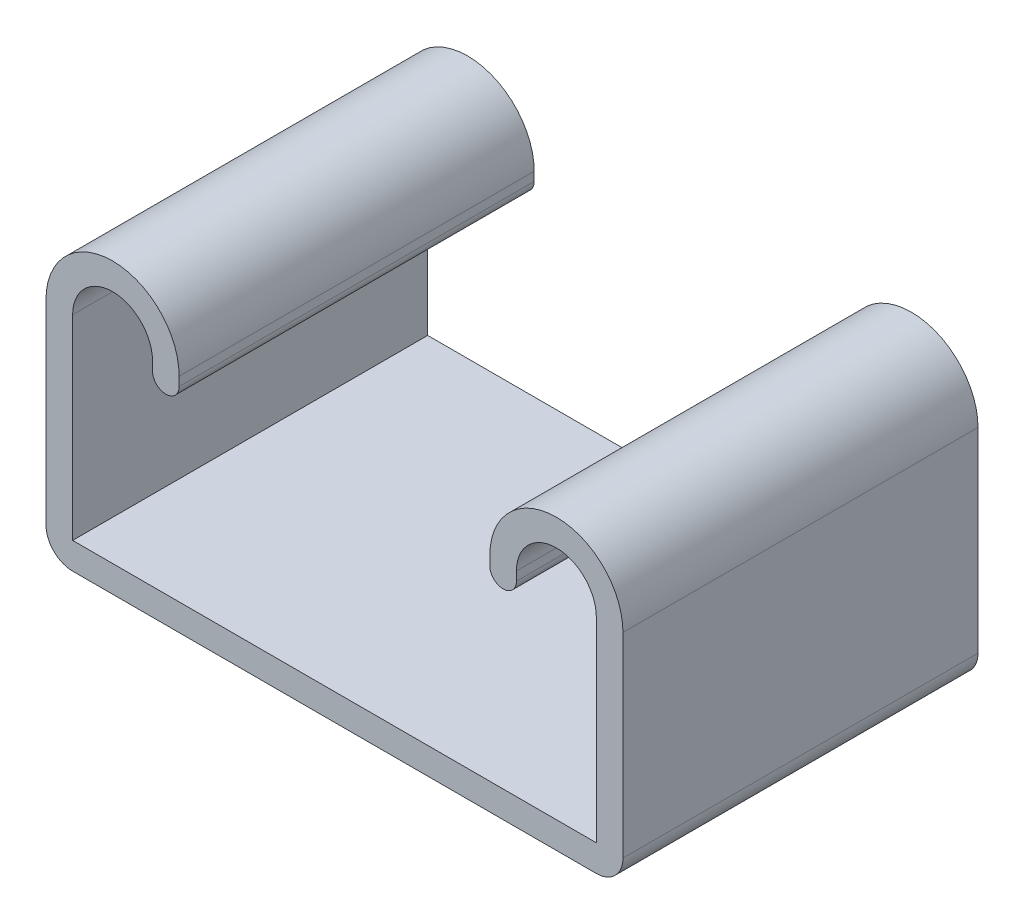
ISO-10303-21;
HEADER;
FILE_DESCRIPTION(('STEP AP214'),'2;1');
FILE_NAME('part.step','',(''),(''),'','','');
FILE_SCHEMA(('AUTOMOTIVE_DESIGN { 1 0 10303 214 1 1 1 1 }'));
ENDSEC;
DATA;
#1=APPLICATION_CONTEXT('core data for automotive mechanical design processes');
#2=APPLICATION_PROTOCOL_DEFINITION('international standard','automotive_design',2000,#1);
#3=PRODUCT_CONTEXT('',#1,'mechanical');
#4=PRODUCT('Part','Part','',(#3));
#5=PRODUCT_RELATED_PRODUCT_CATEGORY('part','',(#4));
#6=PRODUCT_DEFINITION_FORMATION('','',#4);
#7=PRODUCT_DEFINITION_CONTEXT('part definition',#1,'design');
#8=PRODUCT_DEFINITION('design','',#6,#7);
#9=PRODUCT_DEFINITION_SHAPE('','',#8);
#10=(LENGTH_UNIT() NAMED_UNIT(*) SI_UNIT(.MILLI.,.METRE.));
#11=(NAMED_UNIT(*) PLANE_ANGLE_UNIT() SI_UNIT($,.RADIAN.));
#12=(NAMED_UNIT(*) SI_UNIT($,.STERADIAN.) SOLID_ANGLE_UNIT());
#13=UNCERTAINTY_MEASURE_WITH_UNIT(LENGTH_MEASURE(1.E-05),#10,'distance_accuracy_value','');
#14=(GEOMETRIC_REPRESENTATION_CONTEXT(3) GLOBAL_UNCERTAINTY_ASSIGNED_CONTEXT((#13)) GLOBAL_UNIT_ASSIGNED_CONTEXT((#10,
#11,#12)) REPRESENTATION_CONTEXT('',''));
#15=CARTESIAN_POINT('',(0.,0.,0.));
#16=DIRECTION('',(0.,0.,1.));
#17=DIRECTION('',(1.,0.,0.));
#18=AXIS2_PLACEMENT_3D('',#15,#16,#17);
#19=CARTESIAN_POINT('',(-15.875,7.4295,12.7));
#20=DIRECTION('',(0.,0.,-1.));
#21=DIRECTION('',(-1.,0.,0.));
#22=AXIS2_PLACEMENT_3D('',#19,#20,#21);
#23=CYLINDRICAL_SURFACE('',#22,4.7625);
#24=CARTESIAN_POINT('',(-15.875,7.4295,-12.7));
#25=DIRECTION('',(0.,0.,1.));
#26=DIRECTION('',(-1.,0.,0.));
#27=AXIS2_PLACEMENT_3D('',#24,#25,#26);
#28=CIRCLE('',#27,4.7625);
#29=CARTESIAN_POINT('',(-11.1125,7.4295,-12.7));
#30=VERTEX_POINT('',#29);
#31=CARTESIAN_POINT('',(-20.6375,7.4295,-12.7));
#32=VERTEX_POINT('',#31);
#33=EDGE_CURVE('E188',#30,#32,#28,.T.);
#34=ORIENTED_EDGE('',*,*,#33,.T.);
#35=DIRECTION('',(0.,0.,-1.));
#36=VECTOR('',#35,1.);
#37=CARTESIAN_POINT('',(-20.6375,7.4295,12.7));
#38=LINE('',#37,#36);
#39=CARTESIAN_POINT('',(-20.6375,7.4295,12.7));
#40=VERTEX_POINT('',#39);
#41=EDGE_CURVE('E11',#40,#32,#38,.T.);
#42=ORIENTED_EDGE('',*,*,#41,.F.);
#43=CARTESIAN_POINT('',(-15.875,7.4295,12.7));
#44=DIRECTION('',(0.,0.,1.));
#45=DIRECTION('',(-1.,0.,0.));
#46=AXIS2_PLACEMENT_3D('',#43,#44,#45);
#47=CIRCLE('',#46,4.7625);
#48=CARTESIAN_POINT('',(-11.1125,7.4295,12.7));
#49=VERTEX_POINT('',#48);
#50=EDGE_CURVE('E222',#49,#40,#47,.T.);
#51=ORIENTED_EDGE('',*,*,#50,.F.);
#52=DIRECTION('',(0.,0.,-1.));
#53=VECTOR('',#52,1.);
#54=CARTESIAN_POINT('',(-11.1125,7.4295,12.7));
#55=LINE('',#54,#53);
#56=EDGE_CURVE('E184',#49,#30,#55,.T.);
#57=ORIENTED_EDGE('',*,*,#56,.T.);
#58=EDGE_LOOP('',(#34,#42,#51,#57));
#59=FACE_BOUND('',#58,.T.);
#60=ADVANCED_FACE('F32',(#59),#23,.T.);
#61=CARTESIAN_POINT('',(-20.6375,7.4295,12.7));
#62=DIRECTION('',(1.,0.,0.));
#63=DIRECTION('',(0.,0.,-1.));
#64=AXIS2_PLACEMENT_3D('',#61,#62,#63);
#65=PLANE('',#64);
#66=DIRECTION('',(0.,-1.,0.));
#67=VECTOR('',#66,1.);
#68=CARTESIAN_POINT('',(-20.6375,7.4295,-12.7));
#69=LINE('',#68,#67);
#70=CARTESIAN_POINT('',(-20.6375,-6.5532,-12.7));
#71=VERTEX_POINT('',#70);
#72=EDGE_CURVE('E191',#32,#71,#69,.T.);
#73=ORIENTED_EDGE('',*,*,#72,.T.);
#74=DIRECTION('',(0.,0.,-1.));
#75=VECTOR('',#74,1.);
#76=CARTESIAN_POINT('',(-20.6375,-6.5532,12.7));
#77=LINE('',#76,#75);
#78=CARTESIAN_POINT('',(-20.6375,-6.5532,12.7));
#79=VERTEX_POINT('',#78);
#80=EDGE_CURVE('E40',#79,#71,#77,.T.);
#81=ORIENTED_EDGE('',*,*,#80,.F.);
#82=DIRECTION('',(0.,-1.,0.));
#83=VECTOR('',#82,1.);
#84=CARTESIAN_POINT('',(-20.6375,7.4295,12.7));
#85=LINE('',#84,#83);
#86=EDGE_CURVE('E121',#40,#79,#85,.T.);
#87=ORIENTED_EDGE('',*,*,#86,.F.);
#88=ORIENTED_EDGE('',*,*,#41,.T.);
#89=EDGE_LOOP('',(#73,#81,#87,#88));
#90=FACE_BOUND('',#89,.T.);
#91=ADVANCED_FACE('F330',(#90),#65,.F.);
#92=CARTESIAN_POINT('',(-18.7325,-6.5532,12.7));
#93=DIRECTION('',(0.,0.,-1.));
#94=DIRECTION('',(-1.,0.,0.));
#95=AXIS2_PLACEMENT_3D('',#92,#93,#94);
#96=CYLINDRICAL_SURFACE('',#95,1.905);
#97=CARTESIAN_POINT('',(-18.7325,-6.5532,-12.7));
#98=DIRECTION('',(0.,0.,1.));
#99=DIRECTION('',(-1.,0.,0.));
#100=AXIS2_PLACEMENT_3D('',#97,#98,#99);
#101=CIRCLE('',#100,1.905);
#102=CARTESIAN_POINT('',(-18.7325,-8.4582,-12.7));
#103=VERTEX_POINT('',#102);
#104=EDGE_CURVE('E193',#71,#103,#101,.T.);
#105=ORIENTED_EDGE('',*,*,#104,.T.);
#106=DIRECTION('',(0.,0.,-1.));
#107=VECTOR('',#106,1.);
#108=CARTESIAN_POINT('',(-18.7325,-8.4582,12.7));
#109=LINE('',#108,#107);
#110=CARTESIAN_POINT('',(-18.7325,-8.4582,12.7));
#111=VERTEX_POINT('',#110);
#112=EDGE_CURVE('E259',#111,#103,#109,.T.);
#113=ORIENTED_EDGE('',*,*,#112,.F.);
#114=CARTESIAN_POINT('',(-18.7325,-6.5532,12.7));
#115=DIRECTION('',(0.,0.,1.));
#116=DIRECTION('',(-1.,0.,0.));
#117=AXIS2_PLACEMENT_3D('',#114,#115,#116);
#118=CIRCLE('',#117,1.905);
#119=EDGE_CURVE('E267',#79,#111,#118,.T.);
#120=ORIENTED_EDGE('',*,*,#119,.F.);
#121=ORIENTED_EDGE('',*,*,#80,.T.);
#122=EDGE_LOOP('',(#105,#113,#120,#121));
#123=FACE_BOUND('',#122,.T.);
#124=ADVANCED_FACE('F265',(#123),#96,.T.);
#125=CARTESIAN_POINT('',(-18.7325,-8.4582,12.7));
#126=DIRECTION('',(0.,1.,0.));
#127=DIRECTION('',(0.,0.,1.));
#128=AXIS2_PLACEMENT_3D('',#125,#126,#127);
#129=PLANE('',#128);
#130=DIRECTION('',(1.,0.,0.));
#131=VECTOR('',#130,1.);
#132=CARTESIAN_POINT('',(-18.7325,-8.4582,-12.7));
#133=LINE('',#132,#131);
#134=CARTESIAN_POINT('',(18.7325,-8.4582,-12.7));
#135=VERTEX_POINT('',#134);
#136=EDGE_CURVE('E195',#103,#135,#133,.T.);
#137=ORIENTED_EDGE('',*,*,#136,.T.);
#138=DIRECTION('',(0.,0.,-1.));
#139=VECTOR('',#138,1.);
#140=CARTESIAN_POINT('',(18.7325,-8.4582,12.7));
#141=LINE('',#140,#139);
#142=CARTESIAN_POINT('',(18.7325,-8.4582,12.7));
#143=VERTEX_POINT('',#142);
#144=EDGE_CURVE('E256',#143,#135,#141,.T.);
#145=ORIENTED_EDGE('',*,*,#144,.F.);
#146=DIRECTION('',(1.,0.,0.));
#147=VECTOR('',#146,1.);
#148=CARTESIAN_POINT('',(-18.7325,-8.4582,12.7));
#149=LINE('',#148,#147);
#150=EDGE_CURVE('E285',#111,#143,#149,.T.);
#151=ORIENTED_EDGE('',*,*,#150,.F.);
#152=ORIENTED_EDGE('',*,*,#112,.T.);
#153=EDGE_LOOP('',(#137,#145,#151,#152));
#154=FACE_BOUND('',#153,.T.);
#155=ADVANCED_FACE('F276',(#154),#129,.F.);
#156=CARTESIAN_POINT('',(18.7325,-6.5532,12.7));
#157=DIRECTION('',(0.,0.,-1.));
#158=DIRECTION('',(-1.,0.,0.));
#159=AXIS2_PLACEMENT_3D('',#156,#157,#158);
#160=CYLINDRICAL_SURFACE('',#159,1.905);
#161=CARTESIAN_POINT('',(18.7325,-6.5532,-12.7));
#162=DIRECTION('',(0.,0.,1.));
#163=DIRECTION('',(1.,0.,0.));
#164=AXIS2_PLACEMENT_3D('',#161,#162,#163);
#165=CIRCLE('',#164,1.905);
#166=CARTESIAN_POINT('',(20.6375,-6.5532,-12.7));
#167=VERTEX_POINT('',#166);
#168=EDGE_CURVE('E197',#135,#167,#165,.T.);
#169=ORIENTED_EDGE('',*,*,#168,.T.);
#170=DIRECTION('',(0.,0.,-1.));
#171=VECTOR('',#170,1.);
#172=CARTESIAN_POINT('',(20.6375,-6.5532,12.7));
#173=LINE('',#172,#171);
#174=CARTESIAN_POINT('',(20.6375,-6.5532,12.7));
#175=VERTEX_POINT('',#174);
#176=EDGE_CURVE('E253',#175,#167,#173,.T.);
#177=ORIENTED_EDGE('',*,*,#176,.F.);
#178=CARTESIAN_POINT('',(18.7325,-6.5532,12.7));
#179=DIRECTION('',(0.,0.,1.));
#180=DIRECTION('',(1.,0.,0.));
#181=AXIS2_PLACEMENT_3D('',#178,#179,#180);
#182=CIRCLE('',#181,1.905);
#183=EDGE_CURVE('E282',#143,#175,#182,.T.);
#184=ORIENTED_EDGE('',*,*,#183,.F.);
#185=ORIENTED_EDGE('',*,*,#144,.T.);
#186=EDGE_LOOP('',(#169,#177,#184,#185));
#187=FACE_BOUND('',#186,.T.);
#188=ADVANCED_FACE('F280',(#187),#160,.T.);
#189=CARTESIAN_POINT('',(20.6375,-6.5532,12.7));
#190=DIRECTION('',(-1.,0.,0.));
#191=DIRECTION('',(0.,-1.,0.));
#192=AXIS2_PLACEMENT_3D('',#189,#190,#191);
#193=PLANE('',#192);
#194=DIRECTION('',(0.,1.,0.));
#195=VECTOR('',#194,1.);
#196=CARTESIAN_POINT('',(20.6375,-6.5532,-12.7));
#197=LINE('',#196,#195);
#198=CARTESIAN_POINT('',(20.6375,7.4295,-12.7));
#199=VERTEX_POINT('',#198);
#200=EDGE_CURVE('E199',#167,#199,#197,.T.);
#201=ORIENTED_EDGE('',*,*,#200,.T.);
#202=DIRECTION('',(0.,0.,-1.));
#203=VECTOR('',#202,1.);
#204=CARTESIAN_POINT('',(20.6375,7.4295,12.7));
#205=LINE('',#204,#203);
#206=CARTESIAN_POINT('',(20.6375,7.4295,12.7));
#207=VERTEX_POINT('',#206);
#208=EDGE_CURVE('E250',#207,#199,#205,.T.);
#209=ORIENTED_EDGE('',*,*,#208,.F.);
#210=DIRECTION('',(0.,1.,0.));
#211=VECTOR('',#210,1.);
#212=CARTESIAN_POINT('',(20.6375,-6.5532,12.7));
#213=LINE('',#212,#211);
#214=EDGE_CURVE('E284',#175,#207,#213,.T.);
#215=ORIENTED_EDGE('',*,*,#214,.F.);
#216=ORIENTED_EDGE('',*,*,#176,.T.);
#217=EDGE_LOOP('',(#201,#209,#215,#216));
#218=FACE_BOUND('',#217,.T.);
#219=ADVANCED_FACE('F343',(#218),#193,.F.);
#220=CARTESIAN_POINT('',(15.875,7.4295,12.7));
#221=DIRECTION('',(0.,0.,-1.));
#222=DIRECTION('',(-1.,0.,0.));
#223=AXIS2_PLACEMENT_3D('',#220,#221,#222);
#224=CYLINDRICAL_SURFACE('',#223,4.7625);
#225=CARTESIAN_POINT('',(15.875,7.4295,-12.7));
#226=DIRECTION('',(0.,0.,1.));
#227=DIRECTION('',(1.,0.,0.));
#228=AXIS2_PLACEMENT_3D('',#225,#226,#227);
#229=CIRCLE('',#228,4.7625);
#230=CARTESIAN_POINT('',(11.1125,7.4295,-12.7));
#231=VERTEX_POINT('',#230);
#232=EDGE_CURVE('E201',#199,#231,#229,.T.);
#233=ORIENTED_EDGE('',*,*,#232,.T.);
#234=DIRECTION('',(0.,0.,-1.));
#235=VECTOR('',#234,1.);
#236=CARTESIAN_POINT('',(11.1125,7.4295,12.7));
#237=LINE('',#236,#235);
#238=CARTESIAN_POINT('',(11.1125,7.4295,12.7));
#239=VERTEX_POINT('',#238);
#240=EDGE_CURVE('E247',#239,#231,#237,.T.);
#241=ORIENTED_EDGE('',*,*,#240,.F.);
#242=CARTESIAN_POINT('',(15.875,7.4295,12.7));
#243=DIRECTION('',(0.,0.,1.));
#244=DIRECTION('',(1.,0.,0.));
#245=AXIS2_PLACEMENT_3D('',#242,#243,#244);
#246=CIRCLE('',#245,4.7625);
#247=EDGE_CURVE('E287',#207,#239,#246,.T.);
#248=ORIENTED_EDGE('',*,*,#247,.F.);
#249=ORIENTED_EDGE('',*,*,#208,.T.);
#250=EDGE_LOOP('',(#233,#241,#248,#249));
#251=FACE_BOUND('',#250,.T.);
#252=ADVANCED_FACE('F346',(#251),#224,.T.);
#253=CARTESIAN_POINT('',(11.1125,7.4295,12.7));
#254=DIRECTION('',(1.,0.,0.));
#255=DIRECTION('',(0.,1.,0.));
#256=AXIS2_PLACEMENT_3D('',#253,#254,#255);
#257=PLANE('',#256);
#258=DIRECTION('',(0.,-1.,0.));
#259=VECTOR('',#258,1.);
#260=CARTESIAN_POINT('',(11.1125,7.4295,-12.7));
#261=LINE('',#260,#259);
#262=CARTESIAN_POINT('',(11.1125,6.7945,-12.7));
#263=VERTEX_POINT('',#262);
#264=EDGE_CURVE('E203',#231,#263,#261,.T.);
#265=ORIENTED_EDGE('',*,*,#264,.T.);
#266=DIRECTION('',(0.,0.,-1.));
#267=VECTOR('',#266,1.);
#268=CARTESIAN_POINT('',(11.1125,6.7945,12.7));
#269=LINE('',#268,#267);
#270=CARTESIAN_POINT('',(11.1125,6.7945,12.7));
#271=VERTEX_POINT('',#270);
#272=EDGE_CURVE('E244',#271,#263,#269,.T.);
#273=ORIENTED_EDGE('',*,*,#272,.F.);
#274=DIRECTION('',(0.,-1.,0.));
#275=VECTOR('',#274,1.);
#276=CARTESIAN_POINT('',(11.1125,7.4295,12.7));
#277=LINE('',#276,#275);
#278=EDGE_CURVE('E293',#239,#271,#277,.T.);
#279=ORIENTED_EDGE('',*,*,#278,.F.);
#280=ORIENTED_EDGE('',*,*,#240,.T.);
#281=EDGE_LOOP('',(#265,#273,#279,#280));
#282=FACE_BOUND('',#281,.T.);
#283=ADVANCED_FACE('F350',(#282),#257,.F.);
#284=CARTESIAN_POINT('',(12.065,6.7945,12.7));
#285=DIRECTION('',(0.,0.,-1.));
#286=DIRECTION('',(-1.,0.,0.));
#287=AXIS2_PLACEMENT_3D('',#284,#285,#286);
#288=CYLINDRICAL_SURFACE('',#287,0.952500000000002);
#289=CARTESIAN_POINT('',(12.065,6.7945,-12.7));
#290=DIRECTION('',(0.,0.,1.));
#291=DIRECTION('',(1.,0.,0.));
#292=AXIS2_PLACEMENT_3D('',#289,#290,#291);
#293=CIRCLE('',#292,0.952500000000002);
#294=CARTESIAN_POINT('',(13.0175,6.7945,-12.7));
#295=VERTEX_POINT('',#294);
#296=EDGE_CURVE('E205',#263,#295,#293,.T.);
#297=ORIENTED_EDGE('',*,*,#296,.T.);
#298=DIRECTION('',(0.,0.,-1.));
#299=VECTOR('',#298,1.);
#300=CARTESIAN_POINT('',(13.0175,6.7945,12.7));
#301=LINE('',#300,#299);
#302=CARTESIAN_POINT('',(13.0175,6.7945,12.7));
#303=VERTEX_POINT('',#302);
#304=EDGE_CURVE('E241',#303,#295,#301,.T.);
#305=ORIENTED_EDGE('',*,*,#304,.F.);
#306=CARTESIAN_POINT('',(12.065,6.7945,12.7));
#307=DIRECTION('',(0.,0.,1.));
#308=DIRECTION('',(1.,0.,0.));
#309=AXIS2_PLACEMENT_3D('',#306,#307,#308);
#310=CIRCLE('',#309,0.952500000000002);
#311=EDGE_CURVE('E295',#271,#303,#310,.T.);
#312=ORIENTED_EDGE('',*,*,#311,.F.);
#313=ORIENTED_EDGE('',*,*,#272,.T.);
#314=EDGE_LOOP('',(#297,#305,#312,#313));
#315=FACE_BOUND('',#314,.T.);
#316=ADVANCED_FACE('F354',(#315),#288,.T.);
#317=CARTESIAN_POINT('',(13.0175,7.4295,12.7));
#318=DIRECTION('',(-1.,0.,0.));
#319=DIRECTION('',(0.,-1.,0.));
#320=AXIS2_PLACEMENT_3D('',#317,#318,#319);
#321=PLANE('',#320);
#322=DIRECTION('',(0.,1.,0.));
#323=VECTOR('',#322,1.);
#324=CARTESIAN_POINT('',(13.0175,7.4295,-12.7));
#325=LINE('',#324,#323);
#326=CARTESIAN_POINT('',(13.0175,7.4295,-12.7));
#327=VERTEX_POINT('',#326);
#328=EDGE_CURVE('E207',#295,#327,#325,.T.);
#329=ORIENTED_EDGE('',*,*,#328,.T.);
#330=DIRECTION('',(0.,0.,-1.));
#331=VECTOR('',#330,1.);
#332=CARTESIAN_POINT('',(13.0175,7.4295,12.7));
#333=LINE('',#332,#331);
#334=CARTESIAN_POINT('',(13.0175,7.4295,12.7));
#335=VERTEX_POINT('',#334);
#336=EDGE_CURVE('E238',#335,#327,#333,.T.);
#337=ORIENTED_EDGE('',*,*,#336,.F.);
#338=DIRECTION('',(0.,1.,0.));
#339=VECTOR('',#338,1.);
#340=CARTESIAN_POINT('',(13.0175,7.4295,12.7));
#341=LINE('',#340,#339);
#342=EDGE_CURVE('E297',#303,#335,#341,.T.);
#343=ORIENTED_EDGE('',*,*,#342,.F.);
#344=ORIENTED_EDGE('',*,*,#304,.T.);
#345=EDGE_LOOP('',(#329,#337,#343,#344));
#346=FACE_BOUND('',#345,.T.);
#347=ADVANCED_FACE('F358',(#346),#321,.F.);
#348=CARTESIAN_POINT('',(15.875,7.4295,12.7));
#349=DIRECTION('',(0.,0.,-1.));
#350=DIRECTION('',(-1.,0.,0.));
#351=AXIS2_PLACEMENT_3D('',#348,#349,#350);
#352=CYLINDRICAL_SURFACE('',#351,2.8575);
#353=CARTESIAN_POINT('',(15.875,7.4295,-12.7));
#354=DIRECTION('',(0.,0.,-1.));
#355=DIRECTION('',(1.,0.,0.));
#356=AXIS2_PLACEMENT_3D('',#353,#354,#355);
#357=CIRCLE('',#356,2.8575);
#358=CARTESIAN_POINT('',(18.7325,7.4295,-12.7));
#359=VERTEX_POINT('',#358);
#360=EDGE_CURVE('E209',#327,#359,#357,.T.);
#361=ORIENTED_EDGE('',*,*,#360,.T.);
#362=DIRECTION('',(0.,0.,-1.));
#363=VECTOR('',#362,1.);
#364=CARTESIAN_POINT('',(18.7325,7.4295,12.7));
#365=LINE('',#364,#363);
#366=CARTESIAN_POINT('',(18.7325,7.4295,12.7));
#367=VERTEX_POINT('',#366);
#368=EDGE_CURVE('E235',#367,#359,#365,.T.);
#369=ORIENTED_EDGE('',*,*,#368,.F.);
#370=CARTESIAN_POINT('',(15.875,7.4295,12.7));
#371=DIRECTION('',(0.,0.,-1.));
#372=DIRECTION('',(1.,0.,0.));
#373=AXIS2_PLACEMENT_3D('',#370,#371,#372);
#374=CIRCLE('',#373,2.8575);
#375=EDGE_CURVE('E299',#335,#367,#374,.T.);
#376=ORIENTED_EDGE('',*,*,#375,.F.);
#377=ORIENTED_EDGE('',*,*,#336,.T.);
#378=EDGE_LOOP('',(#361,#369,#376,#377));
#379=FACE_BOUND('',#378,.T.);
#380=ADVANCED_FACE('F362',(#379),#352,.F.);
#381=CARTESIAN_POINT('',(18.7325,-6.5532,12.7));
#382=DIRECTION('',(1.,0.,0.));
#383=DIRECTION('',(0.,1.,0.));
#384=AXIS2_PLACEMENT_3D('',#381,#382,#383);
#385=PLANE('',#384);
#386=DIRECTION('',(0.,-1.,0.));
#387=VECTOR('',#386,1.);
#388=CARTESIAN_POINT('',(18.7325,-6.5532,-12.7));
#389=LINE('',#388,#387);
#390=CARTESIAN_POINT('',(18.7325,-6.5532,-12.7));
#391=VERTEX_POINT('',#390);
#392=EDGE_CURVE('E211',#359,#391,#389,.T.);
#393=ORIENTED_EDGE('',*,*,#392,.T.);
#394=DIRECTION('',(0.,0.,-1.));
#395=VECTOR('',#394,1.);
#396=CARTESIAN_POINT('',(18.7325,-6.5532,12.7));
#397=LINE('',#396,#395);
#398=CARTESIAN_POINT('',(18.7325,-6.5532,12.7));
#399=VERTEX_POINT('',#398);
#400=EDGE_CURVE('E232',#399,#391,#397,.T.);
#401=ORIENTED_EDGE('',*,*,#400,.F.);
#402=DIRECTION('',(0.,-1.,0.));
#403=VECTOR('',#402,1.);
#404=CARTESIAN_POINT('',(18.7325,-6.5532,12.7));
#405=LINE('',#404,#403);
#406=EDGE_CURVE('E301',#367,#399,#405,.T.);
#407=ORIENTED_EDGE('',*,*,#406,.F.);
#408=ORIENTED_EDGE('',*,*,#368,.T.);
#409=EDGE_LOOP('',(#393,#401,#407,#408));
#410=FACE_BOUND('',#409,.T.);
#411=ADVANCED_FACE('F366',(#410),#385,.F.);
#412=CARTESIAN_POINT('',(-18.7325,-6.5532,12.7));
#413=DIRECTION('',(0.,-1.,0.));
#414=DIRECTION('',(0.,0.,-1.));
#415=AXIS2_PLACEMENT_3D('',#412,#413,#414);
#416=PLANE('',#415);
#417=DIRECTION('',(-1.,0.,0.));
#418=VECTOR('',#417,1.);
#419=CARTESIAN_POINT('',(-18.7325,-6.5532,-12.7));
#420=LINE('',#419,#418);
#421=CARTESIAN_POINT('',(-18.7325,-6.5532,-12.7));
#422=VERTEX_POINT('',#421);
#423=EDGE_CURVE('E213',#391,#422,#420,.T.);
#424=ORIENTED_EDGE('',*,*,#423,.T.);
#425=DIRECTION('',(0.,0.,-1.));
#426=VECTOR('',#425,1.);
#427=CARTESIAN_POINT('',(-18.7325,-6.5532,12.7));
#428=LINE('',#427,#426);
#429=CARTESIAN_POINT('',(-18.7325,-6.5532,12.7));
#430=VERTEX_POINT('',#429);
#431=EDGE_CURVE('E229',#430,#422,#428,.T.);
#432=ORIENTED_EDGE('',*,*,#431,.F.);
#433=DIRECTION('',(-1.,0.,0.));
#434=VECTOR('',#433,1.);
#435=CARTESIAN_POINT('',(-18.7325,-6.5532,12.7));
#436=LINE('',#435,#434);
#437=EDGE_CURVE('E303',#399,#430,#436,.T.);
#438=ORIENTED_EDGE('',*,*,#437,.F.);
#439=ORIENTED_EDGE('',*,*,#400,.T.);
#440=EDGE_LOOP('',(#424,#432,#438,#439));
#441=FACE_BOUND('',#440,.T.);
#442=ADVANCED_FACE('F370',(#441),#416,.F.);
#443=CARTESIAN_POINT('',(-18.7325,7.4295,12.7));
#444=DIRECTION('',(-1.,0.,0.));
#445=DIRECTION('',(0.,0.,1.));
#446=AXIS2_PLACEMENT_3D('',#443,#444,#445);
#447=PLANE('',#446);
#448=DIRECTION('',(0.,1.,0.));
#449=VECTOR('',#448,1.);
#450=CARTESIAN_POINT('',(-18.7325,7.4295,-12.7));
#451=LINE('',#450,#449);
#452=CARTESIAN_POINT('',(-18.7325,7.4295,-12.7));
#453=VERTEX_POINT('',#452);
#454=EDGE_CURVE('E215',#422,#453,#451,.T.);
#455=ORIENTED_EDGE('',*,*,#454,.T.);
#456=DIRECTION('',(0.,0.,-1.));
#457=VECTOR('',#456,1.);
#458=CARTESIAN_POINT('',(-18.7325,7.4295,12.7));
#459=LINE('',#458,#457);
#460=CARTESIAN_POINT('',(-18.7325,7.4295,12.7));
#461=VERTEX_POINT('',#460);
#462=EDGE_CURVE('E226',#461,#453,#459,.T.);
#463=ORIENTED_EDGE('',*,*,#462,.F.);
#464=DIRECTION('',(0.,1.,0.));
#465=VECTOR('',#464,1.);
#466=CARTESIAN_POINT('',(-18.7325,7.4295,12.7));
#467=LINE('',#466,#465);
#468=EDGE_CURVE('E305',#430,#461,#467,.T.);
#469=ORIENTED_EDGE('',*,*,#468,.F.);
#470=ORIENTED_EDGE('',*,*,#431,.T.);
#471=EDGE_LOOP('',(#455,#463,#469,#470));
#472=FACE_BOUND('',#471,.T.);
#473=ADVANCED_FACE('F311',(#472),#447,.F.);
#474=CARTESIAN_POINT('',(-15.875,7.4295,12.7));
#475=DIRECTION('',(0.,0.,-1.));
#476=DIRECTION('',(-1.,0.,0.));
#477=AXIS2_PLACEMENT_3D('',#474,#475,#476);
#478=CYLINDRICAL_SURFACE('',#477,2.8575);
#479=CARTESIAN_POINT('',(-15.875,7.4295,-12.7));
#480=DIRECTION('',(0.,0.,-1.));
#481=DIRECTION('',(-1.,0.,0.));
#482=AXIS2_PLACEMENT_3D('',#479,#480,#481);
#483=CIRCLE('',#482,2.8575);
#484=CARTESIAN_POINT('',(-13.0175,7.4295,-12.7));
#485=VERTEX_POINT('',#484);
#486=EDGE_CURVE('E217',#453,#485,#483,.T.);
#487=ORIENTED_EDGE('',*,*,#486,.T.);
#488=DIRECTION('',(0.,0.,-1.));
#489=VECTOR('',#488,1.);
#490=CARTESIAN_POINT('',(-13.0175,7.4295,12.7));
#491=LINE('',#490,#489);
#492=CARTESIAN_POINT('',(-13.0175,7.4295,12.7));
#493=VERTEX_POINT('',#492);
#494=EDGE_CURVE('E179',#493,#485,#491,.T.);
#495=ORIENTED_EDGE('',*,*,#494,.F.);
#496=CARTESIAN_POINT('',(-15.875,7.4295,12.7));
#497=DIRECTION('',(0.,0.,-1.));
#498=DIRECTION('',(-1.,0.,0.));
#499=AXIS2_PLACEMENT_3D('',#496,#497,#498);
#500=CIRCLE('',#499,2.8575);
#501=EDGE_CURVE('E170',#461,#493,#500,.T.);
#502=ORIENTED_EDGE('',*,*,#501,.F.);
#503=ORIENTED_EDGE('',*,*,#462,.T.);
#504=EDGE_LOOP('',(#487,#495,#502,#503));
#505=FACE_BOUND('',#504,.T.);
#506=ADVANCED_FACE('F315',(#505),#478,.F.);
#507=CARTESIAN_POINT('',(-13.0175,7.4295,12.7));
#508=DIRECTION('',(1.,0.,0.));
#509=DIRECTION('',(0.,1.,0.));
#510=AXIS2_PLACEMENT_3D('',#507,#508,#509);
#511=PLANE('',#510);
#512=DIRECTION('',(0.,-1.,0.));
#513=VECTOR('',#512,1.);
#514=CARTESIAN_POINT('',(-13.0175,7.4295,-12.7));
#515=LINE('',#514,#513);
#516=CARTESIAN_POINT('',(-13.0175,6.7945,-12.7));
#517=VERTEX_POINT('',#516);
#518=EDGE_CURVE('E178',#485,#517,#515,.T.);
#519=ORIENTED_EDGE('',*,*,#518,.T.);
#520=DIRECTION('',(0.,0.,-1.));
#521=VECTOR('',#520,1.);
#522=CARTESIAN_POINT('',(-13.0175,6.7945,12.7));
#523=LINE('',#522,#521);
#524=CARTESIAN_POINT('',(-13.0175,6.7945,12.7));
#525=VERTEX_POINT('',#524);
#526=EDGE_CURVE('E175',#525,#517,#523,.T.);
#527=ORIENTED_EDGE('',*,*,#526,.F.);
#528=DIRECTION('',(0.,-1.,0.));
#529=VECTOR('',#528,1.);
#530=CARTESIAN_POINT('',(-13.0175,7.4295,12.7));
#531=LINE('',#530,#529);
#532=EDGE_CURVE('E164',#493,#525,#531,.T.);
#533=ORIENTED_EDGE('',*,*,#532,.F.);
#534=ORIENTED_EDGE('',*,*,#494,.T.);
#535=EDGE_LOOP('',(#519,#527,#533,#534));
#536=FACE_BOUND('',#535,.T.);
#537=ADVANCED_FACE('F176',(#536),#511,.F.);
#538=CARTESIAN_POINT('',(-12.065,6.7945,12.7));
#539=DIRECTION('',(0.,0.,-1.));
#540=DIRECTION('',(-1.,0.,0.));
#541=AXIS2_PLACEMENT_3D('',#538,#539,#540);
#542=CYLINDRICAL_SURFACE('',#541,0.952499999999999);
#543=CARTESIAN_POINT('',(-12.065,6.7945,-12.7));
#544=DIRECTION('',(0.,0.,1.));
#545=DIRECTION('',(-1.,0.,0.));
#546=AXIS2_PLACEMENT_3D('',#543,#544,#545);
#547=CIRCLE('',#546,0.952499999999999);
#548=CARTESIAN_POINT('',(-11.1125,6.7945,-12.7));
#549=VERTEX_POINT('',#548);
#550=EDGE_CURVE('E107',#517,#549,#547,.T.);
#551=ORIENTED_EDGE('',*,*,#550,.T.);
#552=DIRECTION('',(0.,0.,-1.));
#553=VECTOR('',#552,1.);
#554=CARTESIAN_POINT('',(-11.1125,6.7945,12.7));
#555=LINE('',#554,#553);
#556=CARTESIAN_POINT('',(-11.1125,6.7945,12.7));
#557=VERTEX_POINT('',#556);
#558=EDGE_CURVE('E180',#557,#549,#555,.T.);
#559=ORIENTED_EDGE('',*,*,#558,.F.);
#560=CARTESIAN_POINT('',(-12.065,6.7945,12.7));
#561=DIRECTION('',(0.,0.,1.));
#562=DIRECTION('',(-1.,0.,0.));
#563=AXIS2_PLACEMENT_3D('',#560,#561,#562);
#564=CIRCLE('',#563,0.952499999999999);
#565=EDGE_CURVE('E168',#525,#557,#564,.T.);
#566=ORIENTED_EDGE('',*,*,#565,.F.);
#567=ORIENTED_EDGE('',*,*,#526,.T.);
#568=EDGE_LOOP('',(#551,#559,#566,#567));
#569=FACE_BOUND('',#568,.T.);
#570=ADVANCED_FACE('F182',(#569),#542,.T.);
#571=CARTESIAN_POINT('',(-11.1125,7.4295,12.7));
#572=DIRECTION('',(-1.,0.,0.));
#573=DIRECTION('',(0.,-1.,0.));
#574=AXIS2_PLACEMENT_3D('',#571,#572,#573);
#575=PLANE('',#574);
#576=DIRECTION('',(0.,1.,0.));
#577=VECTOR('',#576,1.);
#578=CARTESIAN_POINT('',(-11.1125,7.4295,-12.7));
#579=LINE('',#578,#577);
#580=EDGE_CURVE('E113',#549,#30,#579,.T.);
#581=ORIENTED_EDGE('',*,*,#580,.T.);
#582=ORIENTED_EDGE('',*,*,#56,.F.);
#583=DIRECTION('',(0.,1.,0.));
#584=VECTOR('',#583,1.);
#585=CARTESIAN_POINT('',(-11.1125,7.4295,12.7));
#586=LINE('',#585,#584);
#587=EDGE_CURVE('E48',#557,#49,#586,.T.);
#588=ORIENTED_EDGE('',*,*,#587,.F.);
#589=ORIENTED_EDGE('',*,*,#558,.T.);
#590=EDGE_LOOP('',(#581,#582,#588,#589));
#591=FACE_BOUND('',#590,.T.);
#592=ADVANCED_FACE('F319',(#591),#575,.F.);
#593=CARTESIAN_POINT('',(-15.875,7.4295,12.7));
#594=DIRECTION('',(0.,0.,-1.));
#595=DIRECTION('',(-1.,0.,0.));
#596=AXIS2_PLACEMENT_3D('',#593,#594,#595);
#597=PLANE('',#596);
#598=ORIENTED_EDGE('',*,*,#50,.T.);
#599=ORIENTED_EDGE('',*,*,#86,.T.);
#600=ORIENTED_EDGE('',*,*,#119,.T.);
#601=ORIENTED_EDGE('',*,*,#150,.T.);
#602=ORIENTED_EDGE('',*,*,#183,.T.);
#603=ORIENTED_EDGE('',*,*,#214,.T.);
#604=ORIENTED_EDGE('',*,*,#247,.T.);
#605=ORIENTED_EDGE('',*,*,#278,.T.);
#606=ORIENTED_EDGE('',*,*,#311,.T.);
#607=ORIENTED_EDGE('',*,*,#342,.T.);
#608=ORIENTED_EDGE('',*,*,#375,.T.);
#609=ORIENTED_EDGE('',*,*,#406,.T.);
#610=ORIENTED_EDGE('',*,*,#437,.T.);
#611=ORIENTED_EDGE('',*,*,#468,.T.);
#612=ORIENTED_EDGE('',*,*,#501,.T.);
#613=ORIENTED_EDGE('',*,*,#532,.T.);
#614=ORIENTED_EDGE('',*,*,#565,.T.);
#615=ORIENTED_EDGE('',*,*,#587,.T.);
#616=EDGE_LOOP('',(#598,#599,#600,#601,#602,#603,#604,#605,#606,#607,#608,#609,#610,#611,#612,
#613,#614,#615));
#617=FACE_BOUND('',#616,.T.);
#618=ADVANCED_FACE('F166',(#617),#597,.F.);
#619=CARTESIAN_POINT('',(-15.875,7.4295,-12.7));
#620=DIRECTION('',(0.,0.,-1.));
#621=DIRECTION('',(-1.,0.,0.));
#622=AXIS2_PLACEMENT_3D('',#619,#620,#621);
#623=PLANE('',#622);
#624=ORIENTED_EDGE('',*,*,#33,.F.);
#625=ORIENTED_EDGE('',*,*,#580,.F.);
#626=ORIENTED_EDGE('',*,*,#550,.F.);
#627=ORIENTED_EDGE('',*,*,#518,.F.);
#628=ORIENTED_EDGE('',*,*,#486,.F.);
#629=ORIENTED_EDGE('',*,*,#454,.F.);
#630=ORIENTED_EDGE('',*,*,#423,.F.);
#631=ORIENTED_EDGE('',*,*,#392,.F.);
#632=ORIENTED_EDGE('',*,*,#360,.F.);
#633=ORIENTED_EDGE('',*,*,#328,.F.);
#634=ORIENTED_EDGE('',*,*,#296,.F.);
#635=ORIENTED_EDGE('',*,*,#264,.F.);
#636=ORIENTED_EDGE('',*,*,#232,.F.);
#637=ORIENTED_EDGE('',*,*,#200,.F.);
#638=ORIENTED_EDGE('',*,*,#168,.F.);
#639=ORIENTED_EDGE('',*,*,#136,.F.);
#640=ORIENTED_EDGE('',*,*,#104,.F.);
#641=ORIENTED_EDGE('',*,*,#72,.F.);
#642=EDGE_LOOP('',(#624,#625,#626,#627,#628,#629,#630,#631,#632,#633,#634,#635,#636,#637,#638,
#639,#640,#641));
#643=FACE_BOUND('',#642,.T.);
#644=ADVANCED_FACE('F271',(#643),#623,.T.);
#645=CLOSED_SHELL('',(#60,#91,#124,#155,#188,#219,#252,#283,#316,#347,#380,#411,#442,#473,#506,
#537,#570,#592,#618,#644));
#646=MANIFOLD_SOLID_BREP('B2',#645);
#647=ADVANCED_BREP_SHAPE_REPRESENTATION('',(#18,#646),#14);
#648=SHAPE_DEFINITION_REPRESENTATION(#9,#647);
ENDSEC;
END-ISO-10303-21;
